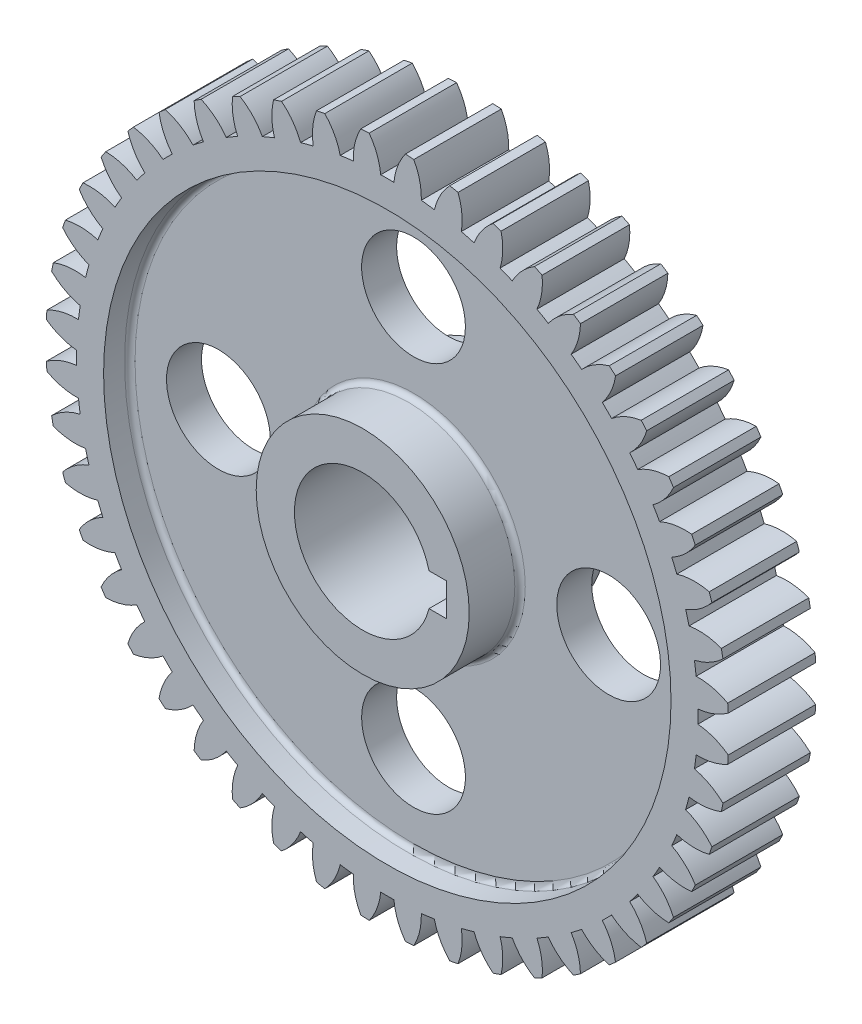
from build123d import *

# Parameters (mm, degrees)
BASPROSKE_W       = 16
BASPROSKE_H       = 62.5
TOOTHCUT_DEPTH    = 8
TEETHCUTS_COUNT   = 48
CSKE_R            = 19.5
EXTRUDE_C_DEPTH   = 12.5
BORESKE_R         = 12.5
BORE_DEPTH        = 40
KEYSKE_W          = 15.3
KEYSKE_H          = 6
KEYWAY_DEPTH      = 40
CUT2SKE_R         = 9.5
CUT2_DEPTH        = 8
CIRPATTERN2_COUNT = 4


with BuildPart() as part:
    # BasProSke → Base-Revolve (revolve)
    with BuildSketch(Plane(origin=(0, 0, 0), x_dir=(0, 0, -1), z_dir=(1, 0, 0)), mode=Mode.PRIVATE) as base_revolve_sk:
        with Locations((0, 31.25)):
            Rectangle(BASPROSKE_W, BASPROSKE_H)
    revolve(base_revolve_sk.sketch.rotate(Axis((0, 0, 53.938223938), (0, 0, -1)), 90), axis=Axis((0, 0, 53.938223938), (0, 0, -1)))

    # ToothCutSke → ToothCut (cut, symmetric)
    with BuildSketch(Plane.XY):
        with BuildLine():
            ThreePointArc((-1.205663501, 56.862219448), (-1.889262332, 59.778945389), (-3.318403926, 62.41184339))
            ThreePointArc((-3.318403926, 62.41184339), (0, 62.5), (3.318403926, 62.41184339))
            ThreePointArc((3.318403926, 62.41184339), (1.889262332, 59.778945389), (1.205663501, 56.862219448))
            ThreePointArc((1.205663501, 56.862219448), (0, 56.875), (-1.205663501, 56.862219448))
        make_face()
    toothcut = extrude(amount=TOOTHCUT_DEPTH, both=True, mode=Mode.SUBTRACT)

    # TeethCuts: ToothCut ×48 about axis
    teethcuts_axis = Axis((0, 0, 0), (0, 0, 1))
    for i in range(1, TEETHCUTS_COUNT):
        add(toothcut.rotate(teethcuts_axis, i * 360 / TEETHCUTS_COUNT), mode=Mode.SUBTRACT)

    # CSke → Extrude C (add, symmetric)
    with BuildSketch(Plane.XY):
        Circle(CSKE_R)
    extrude(amount=EXTRUDE_C_DEPTH, both=True)

    # BoreSke → Bore (cut, symmetric)
    with BuildSketch(Plane.XY):
        Circle(BORESKE_R)
    extrude(amount=BORE_DEPTH, both=True, mode=Mode.SUBTRACT)

    # KeySke → Keyway (cut, symmetric)
    with BuildSketch(Plane.XY):
        with Locations((7.65, 0)):
            Rectangle(KEYSKE_W, KEYSKE_H)
    extrude(amount=KEYWAY_DEPTH, both=True, mode=Mode.SUBTRACT)

    # Cut1Ske → Cut1 (revolve, cut)
    with BuildSketch(Plane(origin=(0, 0, 0), x_dir=(0, 0, -1), z_dir=(1, 0, 0)), mode=Mode.PRIVATE) as cut1_sk:
        with BuildLine():
            Line((-67.2, 51.9375), (-4.16, 51.9375))
            ThreePointArc((-4.16, 51.9375), (-3.48117749, 51.65632251), (-3.2, 50.9775))
            Line((-3.2, 50.9775), (-3.2, 20.46))
            ThreePointArc((-3.2, 20.46), (-3.48117749, 19.78117749), (-4.16, 19.5))
            Line((-4.16, 19.5), (-67.2, 19.5))
            Line((-67.2, 19.5), (-67.2, 51.9375))
        make_face()
        with BuildLine():
            Line((67.2, 19.5), (4.16, 19.5))
            ThreePointArc((4.16, 19.5), (3.48117749, 19.78117749), (3.2, 20.46))
            Line((3.2, 20.46), (3.2, 50.9775))
            ThreePointArc((3.2, 50.9775), (3.48117749, 51.65632251), (4.16, 51.9375))
            Line((4.16, 51.9375), (67.2, 51.9375))
            Line((67.2, 51.9375), (67.2, 19.5))
        make_face()
    revolve(cut1_sk.sketch.rotate(Axis((0, 0, 40.33053973), (0, 0, -1)), 90), axis=Axis((0, 0, 40.33053973), (0, 0, -1)), mode=Mode.SUBTRACT)

    # Cut2Ske → Cut2 (cut, symmetric)
    with BuildSketch(Plane.XY):
        with Locations((0, 35.71875)):
            Circle(CUT2SKE_R)
    cut2 = extrude(amount=CUT2_DEPTH, both=True, mode=Mode.SUBTRACT)

    # CirPattern2: Cut2 ×4 about axis
    cirpattern2_axis = Axis((0, 0, 0), (0, 0, 1))
    for i in range(1, CIRPATTERN2_COUNT):
        add(cut2.rotate(cirpattern2_axis, i * 360 / CIRPATTERN2_COUNT), mode=Mode.SUBTRACT)


solid = part.part
